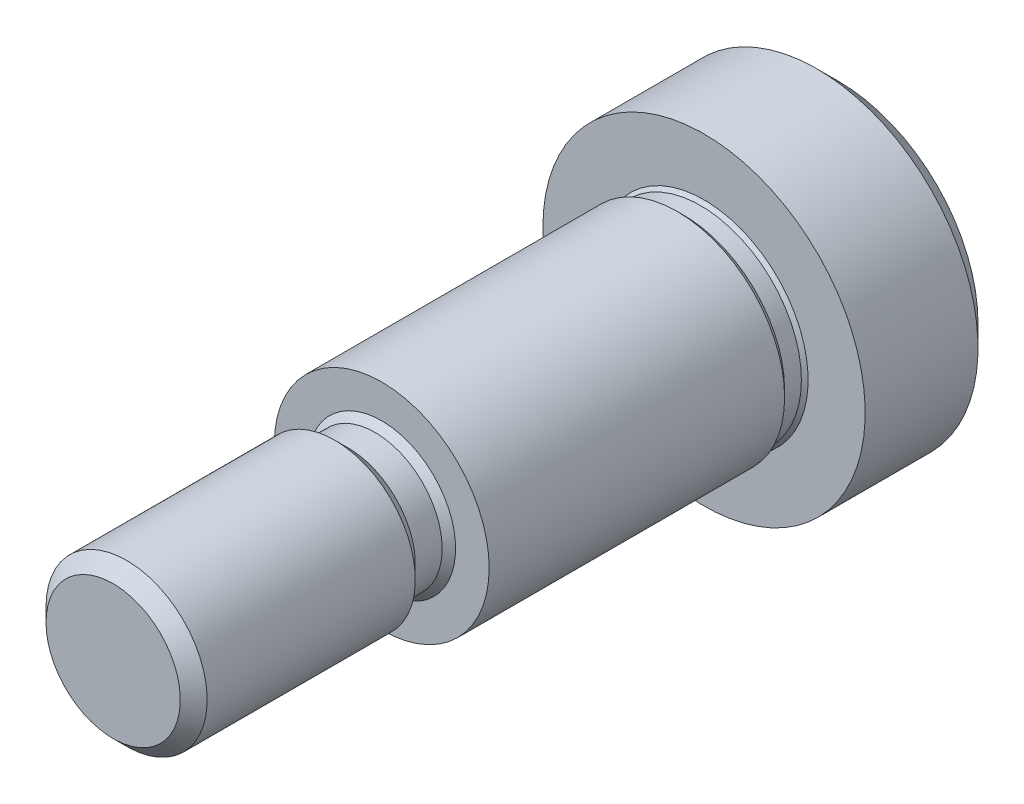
from build123d import *

# Parameters (mm, degrees)
CUT_EXTRUDE1_DEPTH = 5.291666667


with BuildPart() as part:
    # Logo3_bib1 → Revolve1 (revolve)
    with BuildSketch(Plane(origin=(0, 0, 0), x_dir=(-1, 0, 0), z_dir=(0, -1, 0))):
        Polygon((6.35, 0), (4.365625, 0), (3.96875, -0.396875), (3.96875, -1.984375), (4.7625, -2.778125), (4.7625, -15.08125), (3.96875, -15.875), (0, -15.875), (0, 26.9875), (8.255, 26.9875), (9.525, 25.7175), (9.525, 19.05), (6.1515625, 19.05), (5.953125, 18.8515625), (5.953125, 17.859375), (6.35, 17.4625), align=None)
    revolve(axis=Axis((0, 0, -62.352722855), (0, 0, 1)))

    # Logo3_bib2 → Cut-Extrude1 (cut)
    with BuildSketch(Plane(origin=(0, 0, -26.9875), x_dir=(1, 0, 0), z_dir=(0, 0, -1))):
        Polygon((3.666174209, 0), (1.833087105, 3.175), (-1.833087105, 3.175), (-3.666174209, 0), (-1.833087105, -3.175), (1.833087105, -3.175), align=None)
    extrude(amount=-CUT_EXTRUDE1_DEPTH, mode=Mode.SUBTRACT)


solid = part.part
